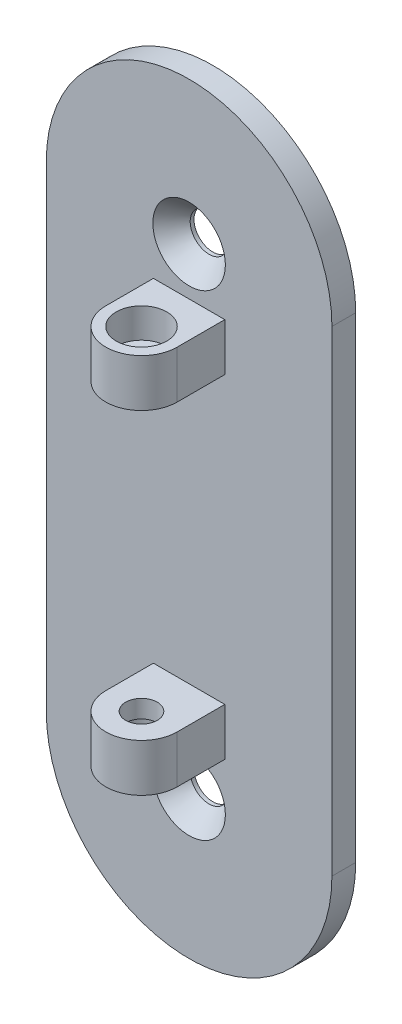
from build123d import *

# Parameters (mm, degrees)
EXTRUDE1_DEPTH                                    = 6.35
SKETCH4_W                                         = 19.05
SKETCH4_H                                         = 12.7
EXTRUDE2_DEPTH                                    = 12.7
EXTRUDE3_DEPTH                                    = 12.7
CBORE_FOR_5_16_SOCKET_HEAD_CAP_SCREW1_D           = 8.4328
CBORE_FOR_5_16_SOCKET_HEAD_CAP_SCREW1_DEPTH       = 12.7
CBORE_FOR_5_16_SOCKET_HEAD_CAP_SCREW1_CBORE_D     = 13.49502
CBORE_FOR_5_16_SOCKET_HEAD_CAP_SCREW1_CBORE_DEPTH = 7.9375
CBORE_FOR_5_16_SOCKET_HEAD_CAP_SCREW1_TIP         = 2.533468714


with BuildPart() as part:
    # Sketch1 → Extrude1 (new body)
    with BuildSketch(Plane.XY):
        with BuildLine():
            Line((0, 0), (0, 63.5))
            ThreePointArc((0, 63.5), (38.1, 101.6), (76.2, 63.5))
            Line((76.2, 63.5), (76.2, 0))
            Line((76.2, 0), (0, 0))
        make_face()
    extrude(amount=EXTRUDE1_DEPTH)

    # Sketch2 → CSK for 3_8 Flat Head Machine Screw1 (revolve, cut)
    with BuildSketch(Plane(origin=(38.1, 63.5, 6.35), x_dir=(0, -1, 0), z_dir=(1, 0, 0))):
        Polygon((0, 0), (0, 6.35), (5.0419, 6.35), (5.0419, 5.332532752), (9.6774, 0), align=None)
    revolve(axis=Axis((38.1, 63.5, 12.7), (0, 0, -1)), mode=Mode.SUBTRACT)

    # Sketch4 → Extrude2 (add)
    with BuildSketch(Plane.XY.offset(6.35)):
        with Locations((38.1, 44.45)):
            Rectangle(SKETCH4_W, SKETCH4_H)
    extrude(amount=EXTRUDE2_DEPTH)

    # Sketch8 → Extrude3 (add)
    with BuildSketch(Plane(origin=(0, 50.8, 0), x_dir=(-1, 0, 0), z_dir=(0, 1, 0))):
        with BuildLine():
            Line((-47.625, 19.05), (-28.575, 19.05))
            ThreePointArc((-28.575, 19.05), (-38.1, 28.575), (-47.625, 19.05))
        make_face()
    extrude(amount=-EXTRUDE3_DEPTH)

    # CBORE for 5_16 Socket Head Cap Screw1
    with Locations(Plane(origin=(0, 50.8, 0), x_dir=(-1, 0, 0), z_dir=(0, 1, 0))):
        with Locations((-38.1, 19.05)):
            CounterBoreHole(CBORE_FOR_5_16_SOCKET_HEAD_CAP_SCREW1_D / 2, CBORE_FOR_5_16_SOCKET_HEAD_CAP_SCREW1_CBORE_D / 2, CBORE_FOR_5_16_SOCKET_HEAD_CAP_SCREW1_CBORE_DEPTH, depth=CBORE_FOR_5_16_SOCKET_HEAD_CAP_SCREW1_DEPTH)
            with Locations((0, 0, -(CBORE_FOR_5_16_SOCKET_HEAD_CAP_SCREW1_DEPTH + CBORE_FOR_5_16_SOCKET_HEAD_CAP_SCREW1_TIP / 2))):  # 118° drill point
                Cone(0, CBORE_FOR_5_16_SOCKET_HEAD_CAP_SCREW1_D / 2, CBORE_FOR_5_16_SOCKET_HEAD_CAP_SCREW1_TIP, mode=Mode.SUBTRACT)

    # Mirror1: part across plane


with BuildPart() as part_1:
    add(part.part)
    add(part.part.mirror(Plane(origin=(76.2, 0, 6.35), x_dir=(0, 0, 1), z_dir=(0, 1, 0))))


solid = part_1.part
